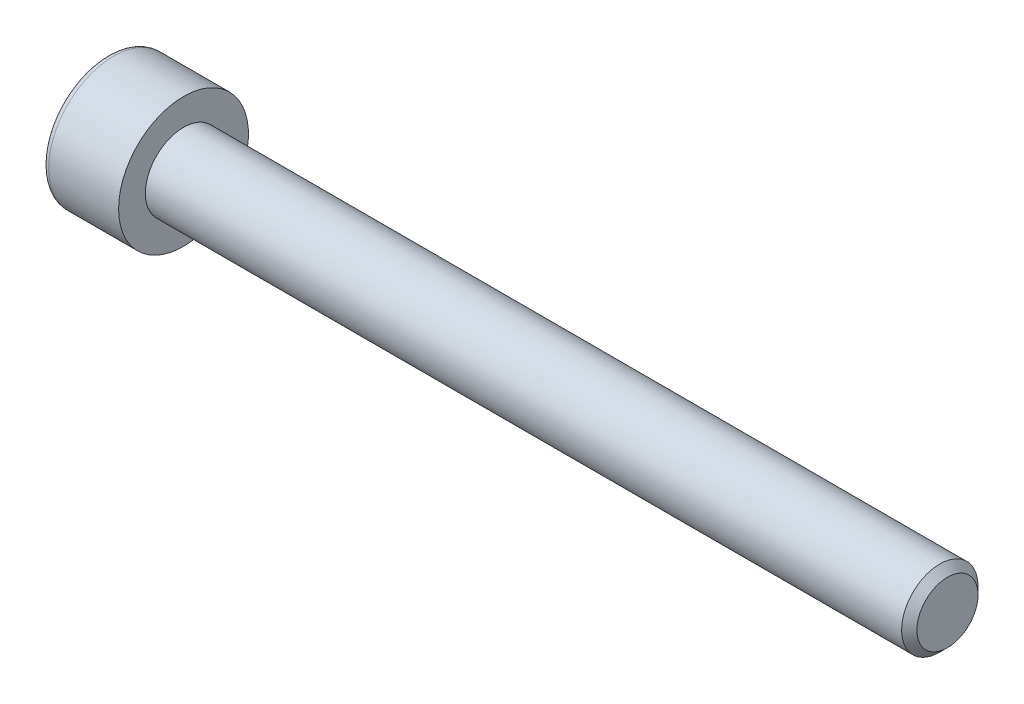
ISO-10303-21;
HEADER;
FILE_DESCRIPTION(('STEP AP214'),'2;1');
FILE_NAME('part.step','',(''),(''),'','','');
FILE_SCHEMA(('AUTOMOTIVE_DESIGN { 1 0 10303 214 1 1 1 1 }'));
ENDSEC;
DATA;
#1=APPLICATION_CONTEXT('core data for automotive mechanical design processes');
#2=APPLICATION_PROTOCOL_DEFINITION('international standard','automotive_design',2000,#1);
#3=PRODUCT_CONTEXT('',#1,'mechanical');
#4=PRODUCT('Part','Part','',(#3));
#5=PRODUCT_RELATED_PRODUCT_CATEGORY('part','',(#4));
#6=PRODUCT_DEFINITION_FORMATION('','',#4);
#7=PRODUCT_DEFINITION_CONTEXT('part definition',#1,'design');
#8=PRODUCT_DEFINITION('design','',#6,#7);
#9=PRODUCT_DEFINITION_SHAPE('','',#8);
#10=(LENGTH_UNIT() NAMED_UNIT(*) SI_UNIT(.MILLI.,.METRE.));
#11=(NAMED_UNIT(*) PLANE_ANGLE_UNIT() SI_UNIT($,.RADIAN.));
#12=(NAMED_UNIT(*) SI_UNIT($,.STERADIAN.) SOLID_ANGLE_UNIT());
#13=UNCERTAINTY_MEASURE_WITH_UNIT(LENGTH_MEASURE(1.E-05),#10,'distance_accuracy_value','');
#14=(GEOMETRIC_REPRESENTATION_CONTEXT(3) GLOBAL_UNCERTAINTY_ASSIGNED_CONTEXT((#13)) GLOBAL_UNIT_ASSIGNED_CONTEXT((#10,
#11,#12)) REPRESENTATION_CONTEXT('',''));
#15=CARTESIAN_POINT('',(0.,0.,0.));
#16=DIRECTION('',(0.,0.,1.));
#17=DIRECTION('',(1.,0.,0.));
#18=AXIS2_PLACEMENT_3D('',#15,#16,#17);
#19=CARTESIAN_POINT('',(0.,0.,0.));
#20=DIRECTION('',(-1.,0.,0.));
#21=DIRECTION('',(0.,0.,1.));
#22=AXIS2_PLACEMENT_3D('',#19,#20,#21);
#23=PLANE('',#22);
#24=CARTESIAN_POINT('',(0.,0.,0.));
#25=DIRECTION('',(-1.,0.,0.));
#26=DIRECTION('',(0.,0.,1.));
#27=AXIS2_PLACEMENT_3D('',#24,#25,#26);
#28=CIRCLE('',#27,4.25);
#29=CARTESIAN_POINT('',(0.,0.,4.25));
#30=VERTEX_POINT('',#29);
#31=EDGE_CURVE('E124',#30,#30,#28,.T.);
#32=ORIENTED_EDGE('',*,*,#31,.F.);
#33=EDGE_LOOP('',(#32));
#34=FACE_BOUND('',#33,.T.);
#35=CARTESIAN_POINT('',(0.,0.,0.));
#36=DIRECTION('',(-1.,0.,0.));
#37=DIRECTION('',(0.,0.,1.));
#38=AXIS2_PLACEMENT_3D('',#35,#36,#37);
#39=CIRCLE('',#38,2.5);
#40=CARTESIAN_POINT('',(0.,0.,2.5));
#41=VERTEX_POINT('',#40);
#42=EDGE_CURVE('E145',#41,#41,#39,.F.);
#43=ORIENTED_EDGE('',*,*,#42,.F.);
#44=EDGE_LOOP('',(#43));
#45=FACE_BOUND('',#44,.T.);
#46=ADVANCED_FACE('F34',(#34,#45),#23,.F.);
#47=CARTESIAN_POINT('',(-5.,3.825,0.));
#48=DIRECTION('',(1.,0.,0.));
#49=DIRECTION('',(0.,0.,-1.));
#50=AXIS2_PLACEMENT_3D('',#47,#48,#49);
#51=PLANE('',#50);
#52=CARTESIAN_POINT('',(-5.,0.,0.));
#53=DIRECTION('',(-1.,0.,0.));
#54=DIRECTION('',(0.,0.,1.));
#55=AXIS2_PLACEMENT_3D('',#52,#53,#54);
#56=CIRCLE('',#55,3.825);
#57=CARTESIAN_POINT('',(-5.,0.,3.825));
#58=VERTEX_POINT('',#57);
#59=EDGE_CURVE('E107',#58,#58,#56,.T.);
#60=ORIENTED_EDGE('',*,*,#59,.T.);
#61=EDGE_LOOP('',(#60));
#62=FACE_BOUND('',#61,.T.);
#63=DIRECTION('',(0.,0.5,0.866025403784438));
#64=VECTOR('',#63,1.);
#65=CARTESIAN_POINT('',(-5.,-0.775800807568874,2.65627358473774));
#66=LINE('',#65,#64);
#67=CARTESIAN_POINT('',(-5.,-2.30940107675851,0.));
#68=VERTEX_POINT('',#67);
#69=CARTESIAN_POINT('',(-5.,-1.15470053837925,2.));
#70=VERTEX_POINT('',#69);
#71=EDGE_CURVE('E142',#68,#70,#66,.T.);
#72=ORIENTED_EDGE('',*,*,#71,.F.);
#73=DIRECTION('',(0.,-0.5,0.866025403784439));
#74=VECTOR('',#73,1.);
#75=CARTESIAN_POINT('',(-5.,-0.775800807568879,-2.65627358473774));
#76=LINE('',#75,#74);
#77=CARTESIAN_POINT('',(-5.,-1.15470053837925,-2.));
#78=VERTEX_POINT('',#77);
#79=EDGE_CURVE('E57',#78,#68,#76,.T.);
#80=ORIENTED_EDGE('',*,*,#79,.F.);
#81=DIRECTION('',(0.,-1.,0.));
#82=VECTOR('',#81,1.);
#83=CARTESIAN_POINT('',(-5.,3.825,-2.));
#84=LINE('',#83,#82);
#85=CARTESIAN_POINT('',(-5.,1.15470053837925,-2.));
#86=VERTEX_POINT('',#85);
#87=EDGE_CURVE('E137',#86,#78,#84,.T.);
#88=ORIENTED_EDGE('',*,*,#87,.F.);
#89=DIRECTION('',(0.,-0.5,-0.866025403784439));
#90=VECTOR('',#89,1.);
#91=CARTESIAN_POINT('',(-5.,2.68830080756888,0.656273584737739));
#92=LINE('',#91,#90);
#93=CARTESIAN_POINT('',(-5.,2.30940107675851,0.));
#94=VERTEX_POINT('',#93);
#95=EDGE_CURVE('E134',#94,#86,#92,.T.);
#96=ORIENTED_EDGE('',*,*,#95,.F.);
#97=DIRECTION('',(0.,0.5,-0.866025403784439));
#98=VECTOR('',#97,1.);
#99=CARTESIAN_POINT('',(-5.,2.68830080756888,-0.656273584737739));
#100=LINE('',#99,#98);
#101=CARTESIAN_POINT('',(-5.,1.15470053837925,2.));
#102=VERTEX_POINT('',#101);
#103=EDGE_CURVE('E131',#102,#94,#100,.T.);
#104=ORIENTED_EDGE('',*,*,#103,.F.);
#105=DIRECTION('',(0.,1.,0.));
#106=VECTOR('',#105,1.);
#107=CARTESIAN_POINT('',(-5.,3.825,2.));
#108=LINE('',#107,#106);
#109=EDGE_CURVE('E128',#70,#102,#108,.T.);
#110=ORIENTED_EDGE('',*,*,#109,.F.);
#111=EDGE_LOOP('',(#72,#80,#88,#96,#104,#110));
#112=FACE_BOUND('',#111,.T.);
#113=ADVANCED_FACE('F162',(#62,#112),#51,.F.);
#114=CARTESIAN_POINT('',(-5.,0.,0.));
#115=DIRECTION('',(-1.,0.,0.));
#116=DIRECTION('',(0.,0.,1.));
#117=AXIS2_PLACEMENT_3D('',#114,#115,#116);
#118=CYLINDRICAL_SURFACE('',#117,4.25);
#119=CARTESIAN_POINT('',(-4.575,0.,0.));
#120=DIRECTION('',(-1.,0.,0.));
#121=DIRECTION('',(0.,0.,1.));
#122=AXIS2_PLACEMENT_3D('',#119,#120,#121);
#123=CIRCLE('',#122,4.25);
#124=CARTESIAN_POINT('',(-4.575,0.,4.25));
#125=VERTEX_POINT('',#124);
#126=EDGE_CURVE('E114',#125,#125,#123,.T.);
#127=ORIENTED_EDGE('',*,*,#126,.F.);
#128=EDGE_LOOP('',(#127));
#129=FACE_BOUND('',#128,.T.);
#130=ORIENTED_EDGE('',*,*,#31,.T.);
#131=EDGE_LOOP('',(#130));
#132=FACE_BOUND('',#131,.T.);
#133=ADVANCED_FACE('F168',(#129,#132),#118,.T.);
#134=CARTESIAN_POINT('',(-4.575,0.,0.));
#135=DIRECTION('',(-1.,0.,0.));
#136=DIRECTION('',(0.,0.,1.));
#137=AXIS2_PLACEMENT_3D('',#134,#135,#136);
#138=TOROIDAL_SURFACE('',#137,3.825,0.425);
#139=ORIENTED_EDGE('',*,*,#59,.F.);
#140=EDGE_LOOP('',(#139));
#141=FACE_BOUND('',#140,.T.);
#142=ORIENTED_EDGE('',*,*,#126,.T.);
#143=EDGE_LOOP('',(#142));
#144=FACE_BOUND('',#143,.T.);
#145=ADVANCED_FACE('F175',(#141,#144),#138,.T.);
#146=CARTESIAN_POINT('',(-2.5,-1.15470053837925,2.));
#147=DIRECTION('',(0.,0.866025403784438,-0.5));
#148=DIRECTION('',(0.,0.5,0.866025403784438));
#149=AXIS2_PLACEMENT_3D('',#146,#147,#148);
#150=PLANE('',#149);
#151=ORIENTED_EDGE('',*,*,#71,.T.);
#152=DIRECTION('',(-1.,0.,0.));
#153=VECTOR('',#152,1.);
#154=CARTESIAN_POINT('',(-2.5,-1.15470053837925,2.));
#155=LINE('',#154,#153);
#156=CARTESIAN_POINT('',(-2.5,-1.15470053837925,2.));
#157=VERTEX_POINT('',#156);
#158=EDGE_CURVE('E49',#157,#70,#155,.T.);
#159=ORIENTED_EDGE('',*,*,#158,.F.);
#160=DIRECTION('',(0.,-0.5,-0.866025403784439));
#161=VECTOR('',#160,1.);
#162=CARTESIAN_POINT('',(-2.5,-1.15470053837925,2.));
#163=LINE('',#162,#161);
#164=CARTESIAN_POINT('',(-2.5,-2.30940107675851,0.));
#165=VERTEX_POINT('',#164);
#166=EDGE_CURVE('E93',#157,#165,#163,.T.);
#167=ORIENTED_EDGE('',*,*,#166,.T.);
#168=DIRECTION('',(-1.,0.,0.));
#169=VECTOR('',#168,1.);
#170=CARTESIAN_POINT('',(-2.5,-2.30940107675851,0.));
#171=LINE('',#170,#169);
#172=EDGE_CURVE('E101',#165,#68,#171,.T.);
#173=ORIENTED_EDGE('',*,*,#172,.T.);
#174=EDGE_LOOP('',(#151,#159,#167,#173));
#175=FACE_BOUND('',#174,.T.);
#176=ADVANCED_FACE('F100',(#175),#150,.T.);
#177=CARTESIAN_POINT('',(-2.5,-2.30940107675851,0.));
#178=DIRECTION('',(0.,0.866025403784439,0.5));
#179=DIRECTION('',(0.,-0.5,0.866025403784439));
#180=AXIS2_PLACEMENT_3D('',#177,#178,#179);
#181=PLANE('',#180);
#182=ORIENTED_EDGE('',*,*,#79,.T.);
#183=ORIENTED_EDGE('',*,*,#172,.F.);
#184=DIRECTION('',(0.,0.5,-0.866025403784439));
#185=VECTOR('',#184,1.);
#186=CARTESIAN_POINT('',(-2.5,-2.30940107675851,0.));
#187=LINE('',#186,#185);
#188=CARTESIAN_POINT('',(-2.5,-1.15470053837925,-2.));
#189=VERTEX_POINT('',#188);
#190=EDGE_CURVE('E89',#165,#189,#187,.T.);
#191=ORIENTED_EDGE('',*,*,#190,.T.);
#192=DIRECTION('',(-1.,0.,0.));
#193=VECTOR('',#192,1.);
#194=CARTESIAN_POINT('',(-2.5,-1.15470053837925,-2.));
#195=LINE('',#194,#193);
#196=EDGE_CURVE('E108',#189,#78,#195,.T.);
#197=ORIENTED_EDGE('',*,*,#196,.T.);
#198=EDGE_LOOP('',(#182,#183,#191,#197));
#199=FACE_BOUND('',#198,.T.);
#200=ADVANCED_FACE('F105',(#199),#181,.T.);
#201=CARTESIAN_POINT('',(-2.5,-1.15470053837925,-2.));
#202=DIRECTION('',(0.,0.,1.));
#203=DIRECTION('',(0.,-1.,0.));
#204=AXIS2_PLACEMENT_3D('',#201,#202,#203);
#205=PLANE('',#204);
#206=ORIENTED_EDGE('',*,*,#87,.T.);
#207=ORIENTED_EDGE('',*,*,#196,.F.);
#208=DIRECTION('',(0.,1.,0.));
#209=VECTOR('',#208,1.);
#210=CARTESIAN_POINT('',(-2.5,-1.15470053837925,-2.));
#211=LINE('',#210,#209);
#212=CARTESIAN_POINT('',(-2.5,1.15470053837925,-2.));
#213=VERTEX_POINT('',#212);
#214=EDGE_CURVE('E95',#189,#213,#211,.T.);
#215=ORIENTED_EDGE('',*,*,#214,.T.);
#216=DIRECTION('',(-1.,0.,0.));
#217=VECTOR('',#216,1.);
#218=CARTESIAN_POINT('',(-2.5,1.15470053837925,-2.));
#219=LINE('',#218,#217);
#220=EDGE_CURVE('E117',#213,#86,#219,.T.);
#221=ORIENTED_EDGE('',*,*,#220,.T.);
#222=EDGE_LOOP('',(#206,#207,#215,#221));
#223=FACE_BOUND('',#222,.T.);
#224=ADVANCED_FACE('F184',(#223),#205,.T.);
#225=CARTESIAN_POINT('',(-2.5,1.15470053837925,-2.));
#226=DIRECTION('',(0.,-0.866025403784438,0.5));
#227=DIRECTION('',(0.,-0.5,-0.866025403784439));
#228=AXIS2_PLACEMENT_3D('',#225,#226,#227);
#229=PLANE('',#228);
#230=ORIENTED_EDGE('',*,*,#95,.T.);
#231=ORIENTED_EDGE('',*,*,#220,.F.);
#232=DIRECTION('',(0.,0.5,0.866025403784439));
#233=VECTOR('',#232,1.);
#234=CARTESIAN_POINT('',(-2.5,1.15470053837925,-2.));
#235=LINE('',#234,#233);
#236=CARTESIAN_POINT('',(-2.5,2.30940107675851,0.));
#237=VERTEX_POINT('',#236);
#238=EDGE_CURVE('E347',#213,#237,#235,.T.);
#239=ORIENTED_EDGE('',*,*,#238,.T.);
#240=DIRECTION('',(-1.,0.,0.));
#241=VECTOR('',#240,1.);
#242=CARTESIAN_POINT('',(-2.5,2.30940107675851,0.));
#243=LINE('',#242,#241);
#244=EDGE_CURVE('E325',#237,#94,#243,.T.);
#245=ORIENTED_EDGE('',*,*,#244,.T.);
#246=EDGE_LOOP('',(#230,#231,#239,#245));
#247=FACE_BOUND('',#246,.T.);
#248=ADVANCED_FACE('F187',(#247),#229,.T.);
#249=CARTESIAN_POINT('',(-2.5,2.30940107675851,0.));
#250=DIRECTION('',(0.,-0.866025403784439,-0.5));
#251=DIRECTION('',(0.,0.5,-0.866025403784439));
#252=AXIS2_PLACEMENT_3D('',#249,#250,#251);
#253=PLANE('',#252);
#254=ORIENTED_EDGE('',*,*,#103,.T.);
#255=ORIENTED_EDGE('',*,*,#244,.F.);
#256=DIRECTION('',(0.,-0.5,0.866025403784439));
#257=VECTOR('',#256,1.);
#258=CARTESIAN_POINT('',(-2.5,2.30940107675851,0.));
#259=LINE('',#258,#257);
#260=CARTESIAN_POINT('',(-2.5,1.15470053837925,2.));
#261=VERTEX_POINT('',#260);
#262=EDGE_CURVE('E328',#237,#261,#259,.T.);
#263=ORIENTED_EDGE('',*,*,#262,.T.);
#264=DIRECTION('',(-1.,0.,0.));
#265=VECTOR('',#264,1.);
#266=CARTESIAN_POINT('',(-2.5,1.15470053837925,2.));
#267=LINE('',#266,#265);
#268=EDGE_CURVE('E319',#261,#102,#267,.T.);
#269=ORIENTED_EDGE('',*,*,#268,.T.);
#270=EDGE_LOOP('',(#254,#255,#263,#269));
#271=FACE_BOUND('',#270,.T.);
#272=ADVANCED_FACE('F191',(#271),#253,.T.);
#273=CARTESIAN_POINT('',(-2.5,1.15470053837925,2.));
#274=DIRECTION('',(0.,0.,-1.));
#275=DIRECTION('',(0.,1.,0.));
#276=AXIS2_PLACEMENT_3D('',#273,#274,#275);
#277=PLANE('',#276);
#278=ORIENTED_EDGE('',*,*,#109,.T.);
#279=ORIENTED_EDGE('',*,*,#268,.F.);
#280=DIRECTION('',(0.,-1.,0.));
#281=VECTOR('',#280,1.);
#282=CARTESIAN_POINT('',(-2.5,1.15470053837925,2.));
#283=LINE('',#282,#281);
#284=EDGE_CURVE('E320',#261,#157,#283,.T.);
#285=ORIENTED_EDGE('',*,*,#284,.T.);
#286=ORIENTED_EDGE('',*,*,#158,.T.);
#287=EDGE_LOOP('',(#278,#279,#285,#286));
#288=FACE_BOUND('',#287,.T.);
#289=ADVANCED_FACE('F195',(#288),#277,.T.);
#290=CARTESIAN_POINT('',(-2.5,-2.30940107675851,0.));
#291=DIRECTION('',(1.,0.,0.));
#292=DIRECTION('',(0.,0.,1.));
#293=AXIS2_PLACEMENT_3D('',#290,#291,#292);
#294=PLANE('',#293);
#295=ORIENTED_EDGE('',*,*,#166,.F.);
#296=ORIENTED_EDGE('',*,*,#284,.F.);
#297=ORIENTED_EDGE('',*,*,#262,.F.);
#298=ORIENTED_EDGE('',*,*,#238,.F.);
#299=ORIENTED_EDGE('',*,*,#214,.F.);
#300=ORIENTED_EDGE('',*,*,#190,.F.);
#301=EDGE_LOOP('',(#295,#296,#297,#298,#299,#300));
#302=FACE_BOUND('',#301,.T.);
#303=ADVANCED_FACE('F91',(#302),#294,.F.);
#304=CARTESIAN_POINT('',(0.,0.,0.));
#305=DIRECTION('',(-1.,0.,0.));
#306=DIRECTION('',(0.,0.,1.));
#307=AXIS2_PLACEMENT_3D('',#304,#305,#306);
#308=CYLINDRICAL_SURFACE('',#307,2.5);
#309=CARTESIAN_POINT('',(49.5,0.,0.));
#310=DIRECTION('',(1.,0.,0.));
#311=DIRECTION('',(0.,0.,-1.));
#312=AXIS2_PLACEMENT_3D('',#309,#310,#311);
#313=CIRCLE('',#312,2.5);
#314=CARTESIAN_POINT('',(49.5,0.,-2.5));
#315=VERTEX_POINT('',#314);
#316=EDGE_CURVE('E11',#315,#315,#313,.F.);
#317=ORIENTED_EDGE('',*,*,#316,.T.);
#318=EDGE_LOOP('',(#317));
#319=FACE_BOUND('',#318,.T.);
#320=ORIENTED_EDGE('',*,*,#42,.T.);
#321=EDGE_LOOP('',(#320));
#322=FACE_BOUND('',#321,.T.);
#323=ADVANCED_FACE('F158',(#319,#322),#308,.T.);
#324=CARTESIAN_POINT('',(50.,0.,0.));
#325=DIRECTION('',(1.,0.,0.));
#326=DIRECTION('',(0.,0.,-1.));
#327=AXIS2_PLACEMENT_3D('',#324,#325,#326);
#328=PLANE('',#327);
#329=CARTESIAN_POINT('',(50.,0.,0.));
#330=DIRECTION('',(1.,0.,0.));
#331=DIRECTION('',(0.,0.,-1.));
#332=AXIS2_PLACEMENT_3D('',#329,#330,#331);
#333=CIRCLE('',#332,2.);
#334=CARTESIAN_POINT('',(50.,0.,-2.));
#335=VERTEX_POINT('',#334);
#336=EDGE_CURVE('E42',#335,#335,#333,.T.);
#337=ORIENTED_EDGE('',*,*,#336,.T.);
#338=EDGE_LOOP('',(#337));
#339=FACE_BOUND('',#338,.T.);
#340=ADVANCED_FACE('F151',(#339),#328,.T.);
#341=CARTESIAN_POINT('',(50.,0.,0.));
#342=DIRECTION('',(-1.,0.,0.));
#343=DIRECTION('',(0.,0.,1.));
#344=AXIS2_PLACEMENT_3D('',#341,#342,#343);
#345=CONICAL_SURFACE('',#344,2.,0.785398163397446);
#346=ORIENTED_EDGE('',*,*,#316,.F.);
#347=EDGE_LOOP('',(#346));
#348=FACE_BOUND('',#347,.T.);
#349=ORIENTED_EDGE('',*,*,#336,.F.);
#350=EDGE_LOOP('',(#349));
#351=FACE_BOUND('',#350,.T.);
#352=ADVANCED_FACE('F36',(#348,#351),#345,.T.);
#353=CLOSED_SHELL('',(#46,#113,#133,#145,#176,#200,#224,#248,#272,#289,#303,#323,#340,#352));
#354=MANIFOLD_SOLID_BREP('B2',#353);
#355=ADVANCED_BREP_SHAPE_REPRESENTATION('',(#18,#354),#14);
#356=SHAPE_DEFINITION_REPRESENTATION(#9,#355);
ENDSEC;
END-ISO-10303-21;
